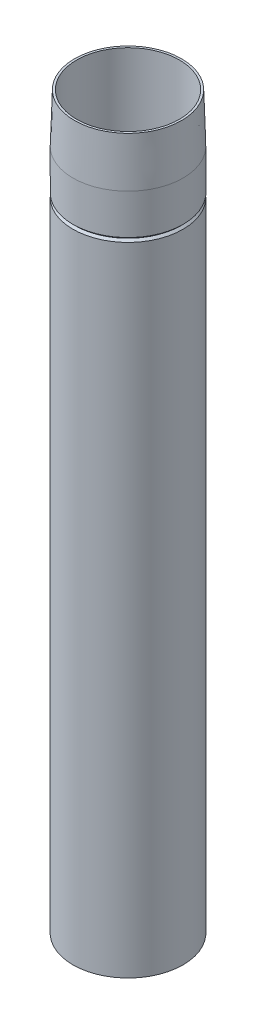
from build123d import *

# Parameters (mm, degrees)
ESQUISSE1_R      = 30.15
ESQUISSE1_R_2    = 28.15
EXTRUSION1_DEPTH = 400


with BuildPart() as part:
    # Esquisse1 → Extrusion1 (new body)
    with BuildSketch(Plane(origin=(0, 0, 0), x_dir=(1, 0, 0), z_dir=(0, 1, 0))):
        with Locations(Location((0, 0, 0), (0, 0, 270))):
            Circle(ESQUISSE1_R)
        with Locations(Location((0, 0, 0), (0, 0, 270))):
            Circle(ESQUISSE1_R_2, mode=Mode.SUBTRACT)
    extrude(amount=EXTRUSION1_DEPTH)

    # Esquisse3 → Enl_vement de mati_re-R_volution1 (revolve, cut)
    with BuildSketch(Plane(origin=(15.224103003, 400, 0), x_dir=(1, 0, 0), z_dir=(0, 0, 1))):
        Polygon((14.086396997, 0), (17.275896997, 0), (17.275896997, -45), (15.492638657, -45), align=None)
        Polygon((17.275896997, -46.5), (13.775896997, -50), (17.275896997, -53.5), align=None)
    revolve(axis=Axis((0, 404.291272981, 0), (0, -1, 0)), mode=Mode.SUBTRACT)


with BuildPart() as enl_vement_de_mati_re_r_volution1_kept_p:
    # of the separate pieces the step leaves, the one the design keeps (enl_vement_de_mati_re_r_volution1_pieces)
    add(part.part.solids().sort_by_distance((0, 0, 30.15))[0])


solid = enl_vement_de_mati_re_r_volution1_kept_p.part
